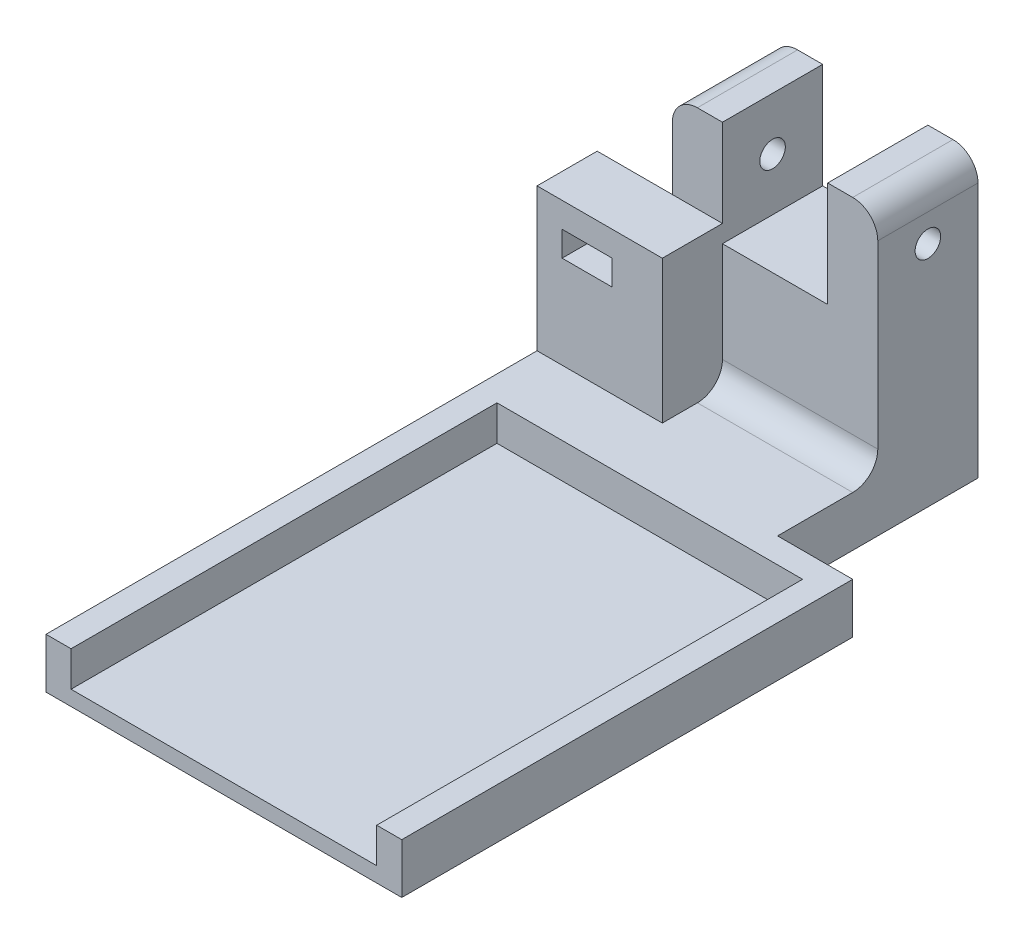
from build123d import *

# Parameters (mm, degrees)
BOSS_EXTRUDE1_DEPTH = 20
SKETCH3_W           = 41
SKETCH3_H           = 10
BOSS_EXTRUDE3_DEPTH = 110
SKETCH18_W          = 90
SKETCH18_H          = 10
BOSS_EXTRUDE4_DEPTH = 15
SKETCH19_W          = 90
SKETCH19_H          = 10
BOSS_EXTRUDE5_DEPTH = 15
SKETCH20_W          = 61
SKETCH20_H          = 80
CUT_EXTRUDE3_DEPTH  = 7
SKETCH21_W          = 61
SKETCH21_H          = 7
CUT_EXTRUDE4_DEPTH  = 7
SKETCH24_W          = 12
SKETCH24_H          = 28.5
BOSS_EXTRUDE6_DEPTH = 10
BOSS_EXTRUDE8_DEPTH = 15
SKETCH11_R          = 2.55
CUT_EXTRUDE1_DEPTH  = 146.932347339
SKETCH27_W          = 10
SKETCH27_H          = 5
CUT_EXTRUDE5_DEPTH  = 114.729943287
FILLET1_R           = 5


with BuildPart() as part:
    # Sketch1 → Boss-Extrude1 (new body)
    with BuildSketch(Plane.XY):
        Polygon((-0.5, -0.5), (20.5, -0.5), (20.5, 20.5), (30.5, 20.5), (30.5, -35.5), (-10.5, -35.5), (-10.5, 20.5), (-0.5, 20.5), align=None)
    extrude(amount=BOSS_EXTRUDE1_DEPTH)

    # Sketch3 → Boss-Extrude3 (add)
    with BuildSketch(Plane.XY.offset(20)):
        with Locations((10, -30.5)):
            Rectangle(SKETCH3_W, SKETCH3_H)
    extrude(amount=BOSS_EXTRUDE3_DEPTH)

    # Sketch18 → Boss-Extrude4 (add)
    with BuildSketch(Plane.ZY.offset(10.5)):
        with Locations((85, -30.5)):
            Rectangle(SKETCH18_W, SKETCH18_H)
    extrude(amount=BOSS_EXTRUDE4_DEPTH)

    # Sketch19 → Boss-Extrude5 (add)
    with BuildSketch(Plane(origin=(30.5, 0, 0), x_dir=(0, 0, -1), z_dir=(1, 0, 0))):
        with Locations((-85, -30.5)):
            Rectangle(SKETCH19_W, SKETCH19_H)
    extrude(amount=BOSS_EXTRUDE5_DEPTH)

    # Sketch20 → Cut-Extrude3 (cut)
    with BuildSketch(Plane(origin=(0, -25.5, 0), x_dir=(1, 0, 0), z_dir=(0, 1, 0))):
        with Locations((10, -85)):
            Rectangle(SKETCH20_W, SKETCH20_H)
    extrude(amount=-CUT_EXTRUDE3_DEPTH, mode=Mode.SUBTRACT)

    # Sketch21 → Cut-Extrude4 (cut)
    with BuildSketch(Plane(origin=(0, 0, 125), x_dir=(-1, 0, 0), z_dir=(0, 0, -1))):
        with Locations((-10, -29)):
            Rectangle(SKETCH21_W, SKETCH21_H)
    extrude(amount=-CUT_EXTRUDE4_DEPTH, mode=Mode.SUBTRACT)

    # Sketch24 → Boss-Extrude6 (add)
    with BuildSketch(Plane.ZY.offset(10.5)):
        with Locations((26, -11.25)):
            Rectangle(SKETCH24_W, SKETCH24_H)
    extrude(amount=-BOSS_EXTRUDE6_DEPTH)

    # Sketch26 → Boss-Extrude8 (add)
    with BuildSketch(Plane.ZY.offset(10.5)):
        Polygon((20, 3), (32, 3), (32, -25.5), (40, -25.5), (40, -35.5), (32, -35.5), (20, -35.5), (20, -25.5), align=None)
    extrude(amount=BOSS_EXTRUDE8_DEPTH)

    # Sketch11 → Cut-Extrude1 (cut, through all)
    with BuildSketch(Plane.ZY.offset(10.5)):
        with Locations(Location((10, 10, 0), (0, 0, 270))):
            Circle(SKETCH11_R)
        with Locations((30, 10)):
            Circle(SKETCH11_R)
    extrude(amount=-CUT_EXTRUDE1_DEPTH, mode=Mode.SUBTRACT)

    # Sketch27 → Cut-Extrude5 (cut, through all)
    with BuildSketch(Plane.XY.offset(32)):
        with Locations((-15.5, -4.5)):
            Rectangle(SKETCH27_W, SKETCH27_H)
    extrude(amount=-CUT_EXTRUDE5_DEPTH, mode=Mode.SUBTRACT)

    # Fillet1
    fillet1_edges = [part.edges().sort_by_distance(p)[0] for p in [
        (30.5, 20.5, 10),
        (-10.5, 20.5, 10),
        (15, -25.5, 20),
    ]]
    fillet(fillet1_edges, radius=FILLET1_R)


solid = part.part
